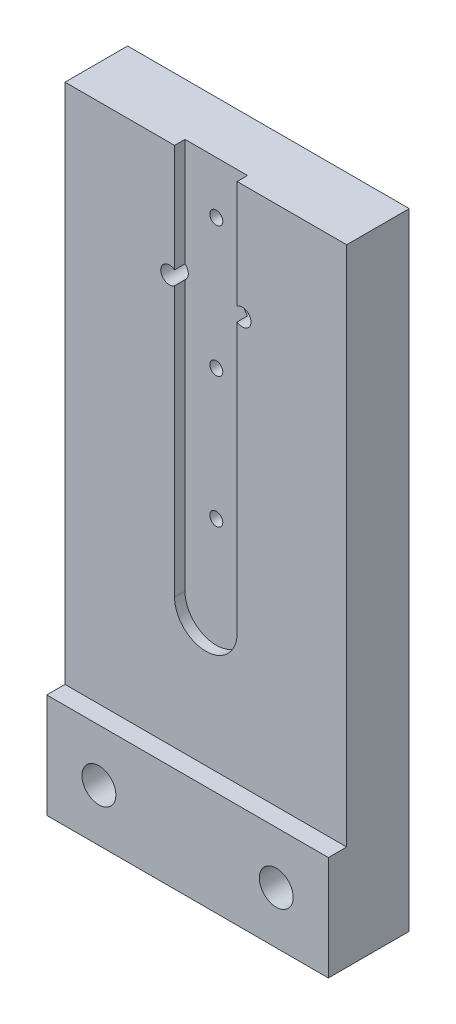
from build123d import *

# Parameters (mm, degrees)
SKETCH_1_W          = 54
SKETCH_1_H          = 120
SKETCH_1_R          = 1.25
SKETCH_1_R_2        = 3.25
SKETCH_1_R_3        = 1.65
EXTRUDE_1_DEPTH     = 15.5
SKETCH_2_OUTSIDE_W  = 44
SKETCH_2_OUTSIDE_H  = 148.5
CUT_EXTRUDE_1_DEPTH = 133.5
CUT_EXTRUDE_2_DEPTH = 2


with BuildPart() as part:
    # Sketch 1 → Extrude 1 (new body)
    with BuildSketch(Plane.XY):
        with Locations((27, 60)):
            Rectangle(SKETCH_1_W, SKETCH_1_H)
        with Locations((27, 110)):
            Circle(SKETCH_1_R, mode=Mode.SUBTRACT)
        with Locations((27, 85)):
            Circle(SKETCH_1_R, mode=Mode.SUBTRACT)
        with Locations((27, 60)):
            Circle(SKETCH_1_R, mode=Mode.SUBTRACT)
        with Locations((10, 10)):
            Circle(SKETCH_1_R_2, mode=Mode.SUBTRACT)
        with Locations((44, 10)):
            Circle(SKETCH_1_R_2, mode=Mode.SUBTRACT)
        with Locations((20, 98)):
            Circle(SKETCH_1_R_3, mode=Mode.SUBTRACT)
        with Locations((34, 98)):
            Circle(SKETCH_1_R_3, mode=Mode.SUBTRACT)
    extrude(amount=EXTRUDE_1_DEPTH)

    # Sketch 2 outside → Cut-Extrude 1 (cut, through all)
    with BuildSketch(Plane(origin=(54, 0, 0), x_dir=(0, 0, -1), z_dir=(1, 0, 0))):
        with Locations((-7.75, 60)):
            Rectangle(SKETCH_2_OUTSIDE_W, SKETCH_2_OUTSIDE_H)
        Polygon((-15.5, 0), (-15.5, 20), (-12, 20), (-12, 120), (0, 120), (0, 0), align=None, mode=Mode.SUBTRACT)
    extrude(amount=-CUT_EXTRUDE_1_DEPTH, mode=Mode.SUBTRACT)

    # Sketch 5 → Cut-Extrude 2 (cut)
    with BuildSketch(Plane.XY.offset(12)):
        with BuildLine():
            Line((21, 45), (21, 96.267949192))
            Line((21, 96.267949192), (21, 99.312440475))
            Line((21, 99.312440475), (21, 120))
            Line((21, 120), (33, 120))
            Line((33, 120), (33, 99.732050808))
            Line((33, 99.732050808), (33, 96.267949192))
            Line((33, 96.267949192), (33, 45))
            ThreePointArc((33, 45), (27, 39), (21, 45))
        make_face()
    extrude(amount=-CUT_EXTRUDE_2_DEPTH, mode=Mode.SUBTRACT)


solid = part.part
